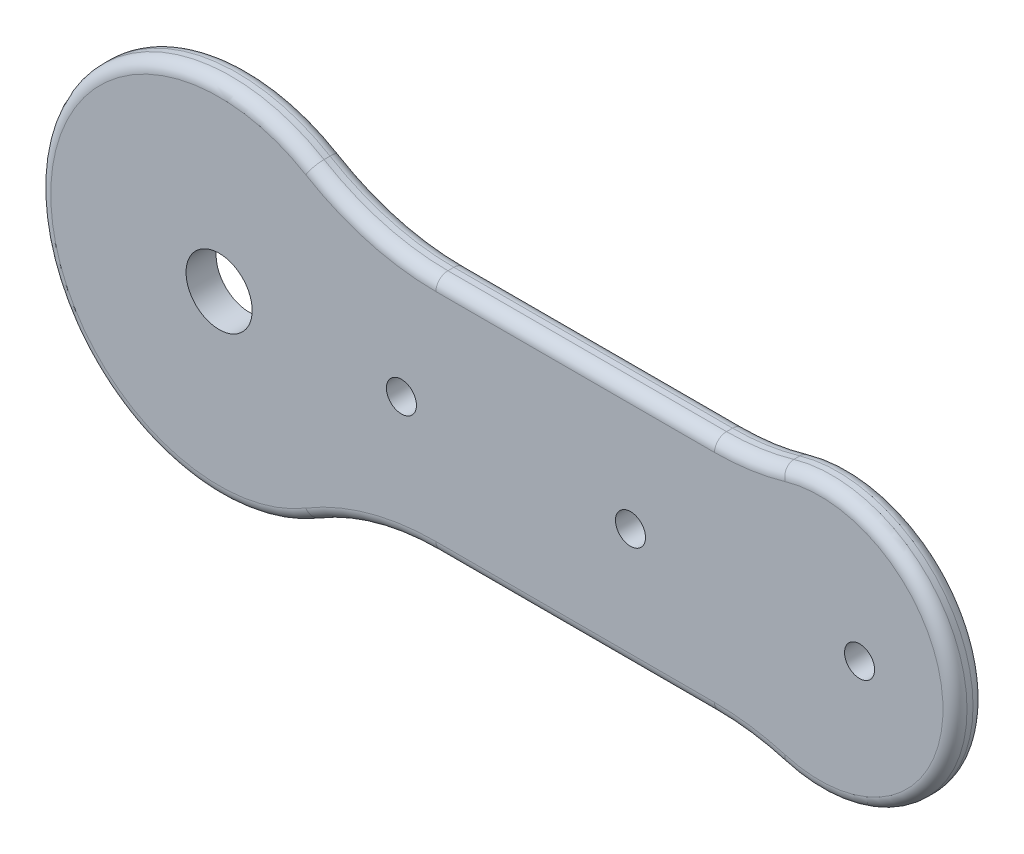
ISO-10303-21;
HEADER;
FILE_DESCRIPTION(('STEP AP214'),'2;1');
FILE_NAME('part.step','',(''),(''),'','','');
FILE_SCHEMA(('AUTOMOTIVE_DESIGN { 1 0 10303 214 1 1 1 1 }'));
ENDSEC;
DATA;
#1=APPLICATION_CONTEXT('core data for automotive mechanical design processes');
#2=APPLICATION_PROTOCOL_DEFINITION('international standard','automotive_design',2000,#1);
#3=PRODUCT_CONTEXT('',#1,'mechanical');
#4=PRODUCT('Part','Part','',(#3));
#5=PRODUCT_RELATED_PRODUCT_CATEGORY('part','',(#4));
#6=PRODUCT_DEFINITION_FORMATION('','',#4);
#7=PRODUCT_DEFINITION_CONTEXT('part definition',#1,'design');
#8=PRODUCT_DEFINITION('design','',#6,#7);
#9=PRODUCT_DEFINITION_SHAPE('','',#8);
#10=(LENGTH_UNIT() NAMED_UNIT(*) SI_UNIT(.MILLI.,.METRE.));
#11=(NAMED_UNIT(*) PLANE_ANGLE_UNIT() SI_UNIT($,.RADIAN.));
#12=(NAMED_UNIT(*) SI_UNIT($,.STERADIAN.) SOLID_ANGLE_UNIT());
#13=UNCERTAINTY_MEASURE_WITH_UNIT(LENGTH_MEASURE(1.E-05),#10,'distance_accuracy_value','');
#14=(GEOMETRIC_REPRESENTATION_CONTEXT(3) GLOBAL_UNCERTAINTY_ASSIGNED_CONTEXT((#13)) GLOBAL_UNIT_ASSIGNED_CONTEXT((#10,
#11,#12)) REPRESENTATION_CONTEXT('',''));
#15=CARTESIAN_POINT('',(0.,0.,0.));
#16=DIRECTION('',(0.,0.,1.));
#17=DIRECTION('',(1.,0.,0.));
#18=AXIS2_PLACEMENT_3D('',#15,#16,#17);
#19=CARTESIAN_POINT('',(0.,40.,10.));
#20=DIRECTION('',(0.,1.,0.));
#21=DIRECTION('',(0.,0.,1.));
#22=AXIS2_PLACEMENT_3D('',#19,#20,#21);
#23=PLANE('',#22);
#24=DIRECTION('',(0.,0.,-1.));
#25=VECTOR('',#24,1.);
#26=CARTESIAN_POINT('',(64.9,40.,10.));
#27=LINE('',#26,#25);
#28=CARTESIAN_POINT('',(64.9,40.,6.));
#29=VERTEX_POINT('',#28);
#30=CARTESIAN_POINT('',(64.9,40.,4.));
#31=VERTEX_POINT('',#30);
#32=EDGE_CURVE('E300',#29,#31,#27,.T.);
#33=ORIENTED_EDGE('',*,*,#32,.T.);
#34=DIRECTION('',(1.,0.,0.));
#35=VECTOR('',#34,1.);
#36=CARTESIAN_POINT('',(-27.7889744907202,40.,4.));
#37=LINE('',#36,#35);
#38=CARTESIAN_POINT('',(-27.7889744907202,40.,4.));
#39=VERTEX_POINT('',#38);
#40=EDGE_CURVE('E163',#31,#39,#37,.F.);
#41=ORIENTED_EDGE('',*,*,#40,.T.);
#42=DIRECTION('',(0.,0.,-1.));
#43=VECTOR('',#42,1.);
#44=CARTESIAN_POINT('',(-27.7889744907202,40.,10.));
#45=LINE('',#44,#43);
#46=CARTESIAN_POINT('',(-27.7889744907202,40.,6.));
#47=VERTEX_POINT('',#46);
#48=EDGE_CURVE('E309',#39,#47,#45,.F.);
#49=ORIENTED_EDGE('',*,*,#48,.T.);
#50=DIRECTION('',(1.,0.,0.));
#51=VECTOR('',#50,1.);
#52=CARTESIAN_POINT('',(0.,40.,6.));
#53=LINE('',#52,#51);
#54=EDGE_CURVE('E195',#47,#29,#53,.T.);
#55=ORIENTED_EDGE('',*,*,#54,.T.);
#56=EDGE_LOOP('',(#33,#41,#49,#55));
#57=FACE_BOUND('',#56,.T.);
#58=ADVANCED_FACE('F43',(#57),#23,.T.);
#59=CARTESIAN_POINT('',(-99.9,0.,10.));
#60=DIRECTION('',(0.,0.,-1.));
#61=DIRECTION('',(-1.,0.,0.));
#62=AXIS2_PLACEMENT_3D('',#59,#60,#61);
#63=CYLINDRICAL_SURFACE('',#62,60.);
#64=DIRECTION('',(0.,0.,-1.));
#65=VECTOR('',#64,1.);
#66=CARTESIAN_POINT('',(-68.9952747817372,51.4285714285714,10.));
#67=LINE('',#66,#65);
#68=CARTESIAN_POINT('',(-68.9952747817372,51.4285714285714,6.));
#69=VERTEX_POINT('',#68);
#70=CARTESIAN_POINT('',(-68.9952747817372,51.4285714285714,4.));
#71=VERTEX_POINT('',#70);
#72=EDGE_CURVE('E289',#69,#71,#67,.T.);
#73=ORIENTED_EDGE('',*,*,#72,.T.);
#74=CARTESIAN_POINT('',(-99.9,0.,4.));
#75=DIRECTION('',(0.,0.,1.));
#76=DIRECTION('',(1.,0.,0.));
#77=AXIS2_PLACEMENT_3D('',#74,#75,#76);
#78=CIRCLE('',#77,60.);
#79=CARTESIAN_POINT('',(-68.9952747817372,-51.4285714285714,4.));
#80=VERTEX_POINT('',#79);
#81=EDGE_CURVE('E200',#71,#80,#78,.T.);
#82=ORIENTED_EDGE('',*,*,#81,.T.);
#83=DIRECTION('',(0.,0.,-1.));
#84=VECTOR('',#83,1.);
#85=CARTESIAN_POINT('',(-68.9952747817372,-51.4285714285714,10.));
#86=LINE('',#85,#84);
#87=CARTESIAN_POINT('',(-68.9952747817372,-51.4285714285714,6.));
#88=VERTEX_POINT('',#87);
#89=EDGE_CURVE('E292',#80,#88,#86,.F.);
#90=ORIENTED_EDGE('',*,*,#89,.T.);
#91=CARTESIAN_POINT('',(-99.9,0.,6.));
#92=DIRECTION('',(0.,0.,1.));
#93=DIRECTION('',(1.,0.,0.));
#94=AXIS2_PLACEMENT_3D('',#91,#92,#93);
#95=CIRCLE('',#94,60.);
#96=EDGE_CURVE('E198',#88,#69,#95,.F.);
#97=ORIENTED_EDGE('',*,*,#96,.T.);
#98=EDGE_LOOP('',(#73,#82,#90,#97));
#99=FACE_BOUND('',#98,.T.);
#100=ADVANCED_FACE('F288',(#99),#63,.T.);
#101=CARTESIAN_POINT('',(0.,-40.,10.));
#102=DIRECTION('',(0.,1.,0.));
#103=DIRECTION('',(0.,0.,1.));
#104=AXIS2_PLACEMENT_3D('',#101,#102,#103);
#105=PLANE('',#104);
#106=DIRECTION('',(0.,0.,1.));
#107=VECTOR('',#106,1.);
#108=CARTESIAN_POINT('',(-27.7889744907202,-40.,0.));
#109=LINE('',#108,#107);
#110=CARTESIAN_POINT('',(-27.7889744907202,-40.,6.));
#111=VERTEX_POINT('',#110);
#112=CARTESIAN_POINT('',(-27.7889744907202,-40.,4.));
#113=VERTEX_POINT('',#112);
#114=EDGE_CURVE('E298',#111,#113,#109,.F.);
#115=ORIENTED_EDGE('',*,*,#114,.T.);
#116=DIRECTION('',(1.,0.,0.));
#117=VECTOR('',#116,1.);
#118=CARTESIAN_POINT('',(0.,-40.,4.));
#119=LINE('',#118,#117);
#120=CARTESIAN_POINT('',(64.9,-40.,4.));
#121=VERTEX_POINT('',#120);
#122=EDGE_CURVE('E204',#113,#121,#119,.T.);
#123=ORIENTED_EDGE('',*,*,#122,.T.);
#124=DIRECTION('',(0.,0.,1.));
#125=VECTOR('',#124,1.);
#126=CARTESIAN_POINT('',(64.9,-40.,10.));
#127=LINE('',#126,#125);
#128=CARTESIAN_POINT('',(64.9,-40.,6.));
#129=VERTEX_POINT('',#128);
#130=EDGE_CURVE('E303',#121,#129,#127,.T.);
#131=ORIENTED_EDGE('',*,*,#130,.T.);
#132=DIRECTION('',(1.,0.,0.));
#133=VECTOR('',#132,1.);
#134=CARTESIAN_POINT('',(-27.7889744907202,-40.,6.));
#135=LINE('',#134,#133);
#136=EDGE_CURVE('E202',#129,#111,#135,.F.);
#137=ORIENTED_EDGE('',*,*,#136,.T.);
#138=EDGE_LOOP('',(#115,#123,#131,#137));
#139=FACE_BOUND('',#138,.T.);
#140=ADVANCED_FACE('F359',(#139),#105,.F.);
#141=CARTESIAN_POINT('',(36.95,0.,10.));
#142=DIRECTION('',(0.,0.,-1.));
#143=DIRECTION('',(-1.,0.,0.));
#144=AXIS2_PLACEMENT_3D('',#141,#142,#143);
#145=CYLINDRICAL_SURFACE('',#144,5.);
#146=CARTESIAN_POINT('',(36.95,0.,10.));
#147=DIRECTION('',(0.,0.,1.));
#148=DIRECTION('',(1.,0.,0.));
#149=AXIS2_PLACEMENT_3D('',#146,#147,#148);
#150=CIRCLE('',#149,5.);
#151=CARTESIAN_POINT('',(41.95,0.,10.));
#152=VERTEX_POINT('',#151);
#153=EDGE_CURVE('E654',#152,#152,#150,.T.);
#154=ORIENTED_EDGE('',*,*,#153,.T.);
#155=EDGE_LOOP('',(#154));
#156=FACE_BOUND('',#155,.T.);
#157=CARTESIAN_POINT('',(36.95,0.,0.));
#158=DIRECTION('',(0.,0.,1.));
#159=DIRECTION('',(1.,0.,0.));
#160=AXIS2_PLACEMENT_3D('',#157,#158,#159);
#161=CIRCLE('',#160,5.);
#162=CARTESIAN_POINT('',(41.95,0.,0.));
#163=VERTEX_POINT('',#162);
#164=EDGE_CURVE('E657',#163,#163,#161,.T.);
#165=ORIENTED_EDGE('',*,*,#164,.F.);
#166=EDGE_LOOP('',(#165));
#167=FACE_BOUND('',#166,.T.);
#168=ADVANCED_FACE('F587',(#156,#167),#145,.F.);
#169=CARTESIAN_POINT('',(-39.25,-1.83164518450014E-13,10.));
#170=DIRECTION('',(0.,0.,-1.));
#171=DIRECTION('',(-1.,0.,0.));
#172=AXIS2_PLACEMENT_3D('',#169,#170,#171);
#173=CYLINDRICAL_SURFACE('',#172,5.);
#174=CARTESIAN_POINT('',(-39.25,-1.83164518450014E-13,10.));
#175=DIRECTION('',(0.,0.,1.));
#176=DIRECTION('',(1.,0.,0.));
#177=AXIS2_PLACEMENT_3D('',#174,#175,#176);
#178=CIRCLE('',#177,5.);
#179=CARTESIAN_POINT('',(-34.25,-1.83164518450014E-13,10.));
#180=VERTEX_POINT('',#179);
#181=EDGE_CURVE('E673',#180,#180,#178,.T.);
#182=ORIENTED_EDGE('',*,*,#181,.T.);
#183=EDGE_LOOP('',(#182));
#184=FACE_BOUND('',#183,.T.);
#185=CARTESIAN_POINT('',(-39.25,-1.83164518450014E-13,0.));
#186=DIRECTION('',(0.,0.,1.));
#187=DIRECTION('',(1.,0.,0.));
#188=AXIS2_PLACEMENT_3D('',#185,#186,#187);
#189=CIRCLE('',#188,5.);
#190=CARTESIAN_POINT('',(-34.25,-1.83164518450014E-13,0.));
#191=VERTEX_POINT('',#190);
#192=EDGE_CURVE('E660',#191,#191,#189,.T.);
#193=ORIENTED_EDGE('',*,*,#192,.F.);
#194=EDGE_LOOP('',(#193));
#195=FACE_BOUND('',#194,.T.);
#196=ADVANCED_FACE('F578',(#184,#195),#173,.F.);
#197=CARTESIAN_POINT('',(-99.9,0.,10.));
#198=DIRECTION('',(0.,0.,-1.));
#199=DIRECTION('',(-1.,0.,0.));
#200=AXIS2_PLACEMENT_3D('',#197,#198,#199);
#201=CYLINDRICAL_SURFACE('',#200,11.);
#202=CARTESIAN_POINT('',(-99.9,0.,10.));
#203=DIRECTION('',(0.,0.,1.));
#204=DIRECTION('',(1.,0.,0.));
#205=AXIS2_PLACEMENT_3D('',#202,#203,#204);
#206=CIRCLE('',#205,11.);
#207=CARTESIAN_POINT('',(-88.9,0.,10.));
#208=VERTEX_POINT('',#207);
#209=EDGE_CURVE('E663',#208,#208,#206,.T.);
#210=ORIENTED_EDGE('',*,*,#209,.T.);
#211=EDGE_LOOP('',(#210));
#212=FACE_BOUND('',#211,.T.);
#213=CARTESIAN_POINT('',(-99.9,0.,0.));
#214=DIRECTION('',(0.,0.,1.));
#215=DIRECTION('',(1.,0.,0.));
#216=AXIS2_PLACEMENT_3D('',#213,#214,#215);
#217=CIRCLE('',#216,11.);
#218=CARTESIAN_POINT('',(-88.9,0.,0.));
#219=VERTEX_POINT('',#218);
#220=EDGE_CURVE('E256',#219,#219,#217,.T.);
#221=ORIENTED_EDGE('',*,*,#220,.F.);
#222=EDGE_LOOP('',(#221));
#223=FACE_BOUND('',#222,.T.);
#224=ADVANCED_FACE('F570',(#212,#223),#201,.F.);
#225=CARTESIAN_POINT('',(99.9,0.,10.));
#226=DIRECTION('',(0.,0.,-1.));
#227=DIRECTION('',(-1.,0.,0.));
#228=AXIS2_PLACEMENT_3D('',#225,#226,#227);
#229=CYLINDRICAL_SURFACE('',#228,45.);
#230=DIRECTION('',(0.,0.,-1.));
#231=VECTOR('',#230,1.);
#232=CARTESIAN_POINT('',(87.3,-43.2,10.));
#233=LINE('',#232,#231);
#234=CARTESIAN_POINT('',(87.3,-43.2,6.));
#235=VERTEX_POINT('',#234);
#236=CARTESIAN_POINT('',(87.3,-43.2,4.));
#237=VERTEX_POINT('',#236);
#238=EDGE_CURVE('E176',#235,#237,#233,.T.);
#239=ORIENTED_EDGE('',*,*,#238,.T.);
#240=CARTESIAN_POINT('',(99.9,0.,4.));
#241=DIRECTION('',(0.,0.,1.));
#242=DIRECTION('',(1.,0.,0.));
#243=AXIS2_PLACEMENT_3D('',#240,#241,#242);
#244=CIRCLE('',#243,45.);
#245=CARTESIAN_POINT('',(87.3,43.2,4.));
#246=VERTEX_POINT('',#245);
#247=EDGE_CURVE('E209',#237,#246,#244,.T.);
#248=ORIENTED_EDGE('',*,*,#247,.T.);
#249=DIRECTION('',(0.,0.,-1.));
#250=VECTOR('',#249,1.);
#251=CARTESIAN_POINT('',(87.3,43.2,10.));
#252=LINE('',#251,#250);
#253=CARTESIAN_POINT('',(87.3,43.2,6.));
#254=VERTEX_POINT('',#253);
#255=EDGE_CURVE('E311',#246,#254,#252,.F.);
#256=ORIENTED_EDGE('',*,*,#255,.T.);
#257=CARTESIAN_POINT('',(99.9,0.,6.));
#258=DIRECTION('',(0.,0.,1.));
#259=DIRECTION('',(1.,0.,0.));
#260=AXIS2_PLACEMENT_3D('',#257,#258,#259);
#261=CIRCLE('',#260,45.);
#262=EDGE_CURVE('E206',#254,#235,#261,.F.);
#263=ORIENTED_EDGE('',*,*,#262,.T.);
#264=EDGE_LOOP('',(#239,#248,#256,#263));
#265=FACE_BOUND('',#264,.T.);
#266=ADVANCED_FACE('F318',(#265),#229,.T.);
#267=CARTESIAN_POINT('',(113.15,0.,10.));
#268=DIRECTION('',(0.,0.,-1.));
#269=DIRECTION('',(-1.,0.,0.));
#270=AXIS2_PLACEMENT_3D('',#267,#268,#269);
#271=CYLINDRICAL_SURFACE('',#270,5.);
#272=CARTESIAN_POINT('',(113.15,0.,10.));
#273=DIRECTION('',(0.,0.,1.));
#274=DIRECTION('',(1.,0.,0.));
#275=AXIS2_PLACEMENT_3D('',#272,#273,#274);
#276=CIRCLE('',#275,5.);
#277=CARTESIAN_POINT('',(118.15,0.,10.));
#278=VERTEX_POINT('',#277);
#279=EDGE_CURVE('E362',#278,#278,#276,.T.);
#280=ORIENTED_EDGE('',*,*,#279,.T.);
#281=EDGE_LOOP('',(#280));
#282=FACE_BOUND('',#281,.T.);
#283=CARTESIAN_POINT('',(113.15,0.,0.));
#284=DIRECTION('',(0.,0.,1.));
#285=DIRECTION('',(1.,0.,0.));
#286=AXIS2_PLACEMENT_3D('',#283,#284,#285);
#287=CIRCLE('',#286,5.);
#288=CARTESIAN_POINT('',(118.15,0.,0.));
#289=VERTEX_POINT('',#288);
#290=EDGE_CURVE('E659',#289,#289,#287,.T.);
#291=ORIENTED_EDGE('',*,*,#290,.F.);
#292=EDGE_LOOP('',(#291));
#293=FACE_BOUND('',#292,.T.);
#294=ADVANCED_FACE('F554',(#282,#293),#271,.F.);
#295=CARTESIAN_POINT('',(0.,0.,10.));
#296=DIRECTION('',(0.,0.,1.));
#297=DIRECTION('',(1.,0.,0.));
#298=AXIS2_PLACEMENT_3D('',#295,#296,#297);
#299=PLANE('',#298);
#300=CARTESIAN_POINT('',(-99.9,0.,10.));
#301=DIRECTION('',(0.,0.,1.));
#302=DIRECTION('',(1.,0.,0.));
#303=AXIS2_PLACEMENT_3D('',#300,#301,#302);
#304=CIRCLE('',#303,56.);
#305=CARTESIAN_POINT('',(-71.0555897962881,48.,10.));
#306=VERTEX_POINT('',#305);
#307=CARTESIAN_POINT('',(-71.0555897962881,-48.,10.));
#308=VERTEX_POINT('',#307);
#309=EDGE_CURVE('E65',#306,#308,#304,.T.);
#310=ORIENTED_EDGE('',*,*,#309,.T.);
#311=CARTESIAN_POINT('',(-27.7889744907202,-120.,10.));
#312=DIRECTION('',(0.,0.,1.));
#313=DIRECTION('',(1.,0.,0.));
#314=AXIS2_PLACEMENT_3D('',#311,#312,#313);
#315=CIRCLE('',#314,84.);
#316=CARTESIAN_POINT('',(-27.7889744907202,-36.,10.));
#317=VERTEX_POINT('',#316);
#318=EDGE_CURVE('E60',#308,#317,#315,.F.);
#319=ORIENTED_EDGE('',*,*,#318,.T.);
#320=DIRECTION('',(1.,0.,0.));
#321=VECTOR('',#320,1.);
#322=CARTESIAN_POINT('',(64.9,-36.,10.));
#323=LINE('',#322,#321);
#324=CARTESIAN_POINT('',(64.9,-36.,10.));
#325=VERTEX_POINT('',#324);
#326=EDGE_CURVE('E223',#317,#325,#323,.T.);
#327=ORIENTED_EDGE('',*,*,#326,.T.);
#328=CARTESIAN_POINT('',(64.9,-120.,10.));
#329=DIRECTION('',(0.,0.,1.));
#330=DIRECTION('',(1.,0.,0.));
#331=AXIS2_PLACEMENT_3D('',#328,#329,#330);
#332=CIRCLE('',#331,84.);
#333=CARTESIAN_POINT('',(88.42,-39.36,10.));
#334=VERTEX_POINT('',#333);
#335=EDGE_CURVE('E218',#325,#334,#332,.F.);
#336=ORIENTED_EDGE('',*,*,#335,.T.);
#337=CARTESIAN_POINT('',(99.9,0.,10.));
#338=DIRECTION('',(0.,0.,1.));
#339=DIRECTION('',(1.,0.,0.));
#340=AXIS2_PLACEMENT_3D('',#337,#338,#339);
#341=CIRCLE('',#340,41.);
#342=CARTESIAN_POINT('',(88.42,39.36,10.));
#343=VERTEX_POINT('',#342);
#344=EDGE_CURVE('E215',#334,#343,#341,.T.);
#345=ORIENTED_EDGE('',*,*,#344,.T.);
#346=CARTESIAN_POINT('',(64.9,120.,10.));
#347=DIRECTION('',(0.,0.,1.));
#348=DIRECTION('',(1.,0.,0.));
#349=AXIS2_PLACEMENT_3D('',#346,#347,#348);
#350=CIRCLE('',#349,84.);
#351=CARTESIAN_POINT('',(64.9,36.,10.));
#352=VERTEX_POINT('',#351);
#353=EDGE_CURVE('E211',#343,#352,#350,.F.);
#354=ORIENTED_EDGE('',*,*,#353,.T.);
#355=DIRECTION('',(1.,0.,0.));
#356=VECTOR('',#355,1.);
#357=CARTESIAN_POINT('',(0.,36.,10.));
#358=LINE('',#357,#356);
#359=CARTESIAN_POINT('',(-27.7889744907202,36.,10.));
#360=VERTEX_POINT('',#359);
#361=EDGE_CURVE('E213',#352,#360,#358,.F.);
#362=ORIENTED_EDGE('',*,*,#361,.T.);
#363=CARTESIAN_POINT('',(-27.7889744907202,120.,10.));
#364=DIRECTION('',(0.,0.,1.));
#365=DIRECTION('',(1.,0.,0.));
#366=AXIS2_PLACEMENT_3D('',#363,#364,#365);
#367=CIRCLE('',#366,84.);
#368=EDGE_CURVE('E220',#360,#306,#367,.F.);
#369=ORIENTED_EDGE('',*,*,#368,.T.);
#370=EDGE_LOOP('',(#310,#319,#327,#336,#345,#354,#362,#369));
#371=FACE_BOUND('',#370,.T.);
#372=ORIENTED_EDGE('',*,*,#209,.F.);
#373=EDGE_LOOP('',(#372));
#374=FACE_BOUND('',#373,.T.);
#375=ORIENTED_EDGE('',*,*,#181,.F.);
#376=EDGE_LOOP('',(#375));
#377=FACE_BOUND('',#376,.T.);
#378=ORIENTED_EDGE('',*,*,#153,.F.);
#379=EDGE_LOOP('',(#378));
#380=FACE_BOUND('',#379,.T.);
#381=ORIENTED_EDGE('',*,*,#279,.F.);
#382=EDGE_LOOP('',(#381));
#383=FACE_BOUND('',#382,.T.);
#384=ADVANCED_FACE('F366',(#371,#374,#377,#380,#383),#299,.T.);
#385=CARTESIAN_POINT('',(0.,0.,0.));
#386=DIRECTION('',(0.,0.,1.));
#387=DIRECTION('',(1.,0.,0.));
#388=AXIS2_PLACEMENT_3D('',#385,#386,#387);
#389=PLANE('',#388);
#390=DIRECTION('',(1.,0.,0.));
#391=VECTOR('',#390,1.);
#392=CARTESIAN_POINT('',(0.,-36.,0.));
#393=LINE('',#392,#391);
#394=CARTESIAN_POINT('',(64.9,-36.,0.));
#395=VERTEX_POINT('',#394);
#396=CARTESIAN_POINT('',(-27.7889744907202,-36.,0.));
#397=VERTEX_POINT('',#396);
#398=EDGE_CURVE('E189',#395,#397,#393,.F.);
#399=ORIENTED_EDGE('',*,*,#398,.T.);
#400=CARTESIAN_POINT('',(-27.7889744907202,-120.,0.));
#401=DIRECTION('',(0.,0.,1.));
#402=DIRECTION('',(1.,0.,0.));
#403=AXIS2_PLACEMENT_3D('',#400,#401,#402);
#404=CIRCLE('',#403,84.);
#405=CARTESIAN_POINT('',(-71.0555897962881,-48.,0.));
#406=VERTEX_POINT('',#405);
#407=EDGE_CURVE('E193',#397,#406,#404,.T.);
#408=ORIENTED_EDGE('',*,*,#407,.T.);
#409=CARTESIAN_POINT('',(-99.9,0.,0.));
#410=DIRECTION('',(0.,0.,1.));
#411=DIRECTION('',(1.,0.,0.));
#412=AXIS2_PLACEMENT_3D('',#409,#410,#411);
#413=CIRCLE('',#412,56.);
#414=CARTESIAN_POINT('',(-71.0555897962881,48.,0.));
#415=VERTEX_POINT('',#414);
#416=EDGE_CURVE('E191',#406,#415,#413,.F.);
#417=ORIENTED_EDGE('',*,*,#416,.T.);
#418=CARTESIAN_POINT('',(-27.7889744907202,120.,0.));
#419=DIRECTION('',(0.,0.,1.));
#420=DIRECTION('',(1.,0.,0.));
#421=AXIS2_PLACEMENT_3D('',#418,#419,#420);
#422=CIRCLE('',#421,84.);
#423=CARTESIAN_POINT('',(-27.7889744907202,36.,0.));
#424=VERTEX_POINT('',#423);
#425=EDGE_CURVE('E181',#415,#424,#422,.T.);
#426=ORIENTED_EDGE('',*,*,#425,.T.);
#427=DIRECTION('',(1.,0.,0.));
#428=VECTOR('',#427,1.);
#429=CARTESIAN_POINT('',(64.9,36.,0.));
#430=LINE('',#429,#428);
#431=CARTESIAN_POINT('',(64.9,36.,0.));
#432=VERTEX_POINT('',#431);
#433=EDGE_CURVE('E161',#424,#432,#430,.T.);
#434=ORIENTED_EDGE('',*,*,#433,.T.);
#435=CARTESIAN_POINT('',(64.9,120.,0.));
#436=DIRECTION('',(0.,0.,1.));
#437=DIRECTION('',(1.,0.,0.));
#438=AXIS2_PLACEMENT_3D('',#435,#436,#437);
#439=CIRCLE('',#438,84.);
#440=CARTESIAN_POINT('',(88.42,39.36,0.));
#441=VERTEX_POINT('',#440);
#442=EDGE_CURVE('E169',#432,#441,#439,.T.);
#443=ORIENTED_EDGE('',*,*,#442,.T.);
#444=CARTESIAN_POINT('',(99.9,0.,0.));
#445=DIRECTION('',(0.,0.,1.));
#446=DIRECTION('',(1.,0.,0.));
#447=AXIS2_PLACEMENT_3D('',#444,#445,#446);
#448=CIRCLE('',#447,41.);
#449=CARTESIAN_POINT('',(88.42,-39.36,0.));
#450=VERTEX_POINT('',#449);
#451=EDGE_CURVE('E175',#441,#450,#448,.F.);
#452=ORIENTED_EDGE('',*,*,#451,.T.);
#453=CARTESIAN_POINT('',(64.9,-120.,0.));
#454=DIRECTION('',(0.,0.,1.));
#455=DIRECTION('',(1.,0.,0.));
#456=AXIS2_PLACEMENT_3D('',#453,#454,#455);
#457=CIRCLE('',#456,84.);
#458=EDGE_CURVE('E183',#450,#395,#457,.T.);
#459=ORIENTED_EDGE('',*,*,#458,.T.);
#460=EDGE_LOOP('',(#399,#408,#417,#426,#434,#443,#452,#459));
#461=FACE_BOUND('',#460,.T.);
#462=ORIENTED_EDGE('',*,*,#220,.T.);
#463=EDGE_LOOP('',(#462));
#464=FACE_BOUND('',#463,.T.);
#465=ORIENTED_EDGE('',*,*,#192,.T.);
#466=EDGE_LOOP('',(#465));
#467=FACE_BOUND('',#466,.T.);
#468=ORIENTED_EDGE('',*,*,#164,.T.);
#469=EDGE_LOOP('',(#468));
#470=FACE_BOUND('',#469,.T.);
#471=ORIENTED_EDGE('',*,*,#290,.T.);
#472=EDGE_LOOP('',(#471));
#473=FACE_BOUND('',#472,.T.);
#474=ADVANCED_FACE('F178',(#461,#464,#467,#470,#473),#389,.F.);
#475=CARTESIAN_POINT('',(-27.7889744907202,-120.,10.));
#476=DIRECTION('',(0.,0.,-1.));
#477=DIRECTION('',(-1.,0.,0.));
#478=AXIS2_PLACEMENT_3D('',#475,#476,#477);
#479=CYLINDRICAL_SURFACE('',#478,80.);
#480=ORIENTED_EDGE('',*,*,#89,.F.);
#481=CARTESIAN_POINT('',(-27.7889744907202,-120.,4.));
#482=DIRECTION('',(0.,0.,1.));
#483=DIRECTION('',(1.,0.,0.));
#484=AXIS2_PLACEMENT_3D('',#481,#482,#483);
#485=CIRCLE('',#484,80.);
#486=EDGE_CURVE('E228',#80,#113,#485,.F.);
#487=ORIENTED_EDGE('',*,*,#486,.T.);
#488=ORIENTED_EDGE('',*,*,#114,.F.);
#489=CARTESIAN_POINT('',(-27.7889744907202,-120.,6.));
#490=DIRECTION('',(0.,0.,1.));
#491=DIRECTION('',(1.,0.,0.));
#492=AXIS2_PLACEMENT_3D('',#489,#490,#491);
#493=CIRCLE('',#492,80.);
#494=EDGE_CURVE('E226',#111,#88,#493,.T.);
#495=ORIENTED_EDGE('',*,*,#494,.T.);
#496=EDGE_LOOP('',(#480,#487,#488,#495));
#497=FACE_BOUND('',#496,.T.);
#498=ADVANCED_FACE('F385',(#497),#479,.F.);
#499=CARTESIAN_POINT('',(-27.7889744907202,120.,10.));
#500=DIRECTION('',(0.,0.,-1.));
#501=DIRECTION('',(-1.,0.,0.));
#502=AXIS2_PLACEMENT_3D('',#499,#500,#501);
#503=CYLINDRICAL_SURFACE('',#502,80.);
#504=ORIENTED_EDGE('',*,*,#48,.F.);
#505=CARTESIAN_POINT('',(-27.7889744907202,120.,4.));
#506=DIRECTION('',(0.,0.,1.));
#507=DIRECTION('',(1.,0.,0.));
#508=AXIS2_PLACEMENT_3D('',#505,#506,#507);
#509=CIRCLE('',#508,80.);
#510=EDGE_CURVE('E232',#39,#71,#509,.F.);
#511=ORIENTED_EDGE('',*,*,#510,.T.);
#512=ORIENTED_EDGE('',*,*,#72,.F.);
#513=CARTESIAN_POINT('',(-27.7889744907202,120.,6.));
#514=DIRECTION('',(0.,0.,1.));
#515=DIRECTION('',(1.,0.,0.));
#516=AXIS2_PLACEMENT_3D('',#513,#514,#515);
#517=CIRCLE('',#516,80.);
#518=EDGE_CURVE('E230',#69,#47,#517,.T.);
#519=ORIENTED_EDGE('',*,*,#518,.T.);
#520=EDGE_LOOP('',(#504,#511,#512,#519));
#521=FACE_BOUND('',#520,.T.);
#522=ADVANCED_FACE('F295',(#521),#503,.F.);
#523=CARTESIAN_POINT('',(64.9,-120.,10.));
#524=DIRECTION('',(0.,0.,-1.));
#525=DIRECTION('',(-1.,0.,0.));
#526=AXIS2_PLACEMENT_3D('',#523,#524,#525);
#527=CYLINDRICAL_SURFACE('',#526,80.);
#528=ORIENTED_EDGE('',*,*,#130,.F.);
#529=CARTESIAN_POINT('',(64.9,-120.,4.));
#530=DIRECTION('',(0.,0.,1.));
#531=DIRECTION('',(1.,0.,0.));
#532=AXIS2_PLACEMENT_3D('',#529,#530,#531);
#533=CIRCLE('',#532,80.);
#534=EDGE_CURVE('E236',#121,#237,#533,.F.);
#535=ORIENTED_EDGE('',*,*,#534,.T.);
#536=ORIENTED_EDGE('',*,*,#238,.F.);
#537=CARTESIAN_POINT('',(64.9,-120.,6.));
#538=DIRECTION('',(0.,0.,1.));
#539=DIRECTION('',(1.,0.,0.));
#540=AXIS2_PLACEMENT_3D('',#537,#538,#539);
#541=CIRCLE('',#540,80.);
#542=EDGE_CURVE('E234',#235,#129,#541,.T.);
#543=ORIENTED_EDGE('',*,*,#542,.T.);
#544=EDGE_LOOP('',(#528,#535,#536,#543));
#545=FACE_BOUND('',#544,.T.);
#546=ADVANCED_FACE('F355',(#545),#527,.F.);
#547=CARTESIAN_POINT('',(64.9,120.,10.));
#548=DIRECTION('',(0.,0.,-1.));
#549=DIRECTION('',(-1.,0.,0.));
#550=AXIS2_PLACEMENT_3D('',#547,#548,#549);
#551=CYLINDRICAL_SURFACE('',#550,80.);
#552=ORIENTED_EDGE('',*,*,#255,.F.);
#553=CARTESIAN_POINT('',(64.9,120.,4.));
#554=DIRECTION('',(0.,0.,1.));
#555=DIRECTION('',(1.,0.,0.));
#556=AXIS2_PLACEMENT_3D('',#553,#554,#555);
#557=CIRCLE('',#556,80.);
#558=EDGE_CURVE('E11',#246,#31,#557,.F.);
#559=ORIENTED_EDGE('',*,*,#558,.T.);
#560=ORIENTED_EDGE('',*,*,#32,.F.);
#561=CARTESIAN_POINT('',(64.9,120.,6.));
#562=DIRECTION('',(0.,0.,1.));
#563=DIRECTION('',(1.,0.,0.));
#564=AXIS2_PLACEMENT_3D('',#561,#562,#563);
#565=CIRCLE('',#564,80.);
#566=EDGE_CURVE('E52',#29,#254,#565,.T.);
#567=ORIENTED_EDGE('',*,*,#566,.T.);
#568=EDGE_LOOP('',(#552,#559,#560,#567));
#569=FACE_BOUND('',#568,.T.);
#570=ADVANCED_FACE('F331',(#569),#551,.F.);
#571=CARTESIAN_POINT('',(0.,-36.,4.));
#572=DIRECTION('',(1.,0.,0.));
#573=DIRECTION('',(0.,0.,-1.));
#574=AXIS2_PLACEMENT_3D('',#571,#572,#573);
#575=CYLINDRICAL_SURFACE('',#574,4.);
#576=CARTESIAN_POINT('',(64.9,-36.,4.));
#577=DIRECTION('',(1.,0.,0.));
#578=DIRECTION('',(0.,0.,-1.));
#579=AXIS2_PLACEMENT_3D('',#576,#577,#578);
#580=CIRCLE('',#579,4.);
#581=EDGE_CURVE('E250',#121,#395,#580,.T.);
#582=ORIENTED_EDGE('',*,*,#581,.F.);
#583=ORIENTED_EDGE('',*,*,#122,.F.);
#584=CARTESIAN_POINT('',(-27.7889744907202,-36.,4.));
#585=DIRECTION('',(-1.,0.,0.));
#586=DIRECTION('',(0.,0.,1.));
#587=AXIS2_PLACEMENT_3D('',#584,#585,#586);
#588=CIRCLE('',#587,4.);
#589=EDGE_CURVE('E253',#397,#113,#588,.T.);
#590=ORIENTED_EDGE('',*,*,#589,.F.);
#591=ORIENTED_EDGE('',*,*,#398,.F.);
#592=EDGE_LOOP('',(#582,#583,#590,#591));
#593=FACE_BOUND('',#592,.T.);
#594=ADVANCED_FACE('F395',(#593),#575,.T.);
#595=CARTESIAN_POINT('',(-27.7889744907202,-120.,4.));
#596=DIRECTION('',(0.,0.,1.));
#597=DIRECTION('',(1.,0.,0.));
#598=AXIS2_PLACEMENT_3D('',#595,#596,#597);
#599=TOROIDAL_SURFACE('',#598,84.,4.);
#600=ORIENTED_EDGE('',*,*,#589,.T.);
#601=ORIENTED_EDGE('',*,*,#486,.F.);
#602=CARTESIAN_POINT('',(-71.0555897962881,-48.,4.));
#603=DIRECTION('',(-0.857142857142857,-0.515078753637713,0.));
#604=DIRECTION('',(0.515078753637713,-0.857142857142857,0.));
#605=AXIS2_PLACEMENT_3D('',#602,#603,#604);
#606=CIRCLE('',#605,4.);
#607=EDGE_CURVE('E247',#406,#80,#606,.T.);
#608=ORIENTED_EDGE('',*,*,#607,.F.);
#609=ORIENTED_EDGE('',*,*,#407,.F.);
#610=EDGE_LOOP('',(#600,#601,#608,#609));
#611=FACE_BOUND('',#610,.T.);
#612=ADVANCED_FACE('F412',(#611),#599,.T.);
#613=CARTESIAN_POINT('',(64.9,-120.,4.));
#614=DIRECTION('',(0.,0.,1.));
#615=DIRECTION('',(1.,0.,0.));
#616=AXIS2_PLACEMENT_3D('',#613,#614,#615);
#617=TOROIDAL_SURFACE('',#616,84.,4.);
#618=ORIENTED_EDGE('',*,*,#581,.T.);
#619=ORIENTED_EDGE('',*,*,#458,.F.);
#620=CARTESIAN_POINT('',(88.42,-39.36,4.));
#621=DIRECTION('',(0.96,-0.279999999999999,0.));
#622=DIRECTION('',(0.279999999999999,0.96,0.));
#623=AXIS2_PLACEMENT_3D('',#620,#621,#622);
#624=CIRCLE('',#623,4.);
#625=EDGE_CURVE('E244',#237,#450,#624,.T.);
#626=ORIENTED_EDGE('',*,*,#625,.F.);
#627=ORIENTED_EDGE('',*,*,#534,.F.);
#628=EDGE_LOOP('',(#618,#619,#626,#627));
#629=FACE_BOUND('',#628,.T.);
#630=ADVANCED_FACE('F326',(#629),#617,.T.);
#631=CARTESIAN_POINT('',(-99.9,0.,4.));
#632=DIRECTION('',(0.,0.,1.));
#633=DIRECTION('',(1.,0.,0.));
#634=AXIS2_PLACEMENT_3D('',#631,#632,#633);
#635=TOROIDAL_SURFACE('',#634,56.,4.);
#636=ORIENTED_EDGE('',*,*,#607,.T.);
#637=ORIENTED_EDGE('',*,*,#81,.F.);
#638=CARTESIAN_POINT('',(-71.0555897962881,48.,4.));
#639=DIRECTION('',(0.857142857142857,-0.515078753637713,0.));
#640=DIRECTION('',(0.515078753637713,0.857142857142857,0.));
#641=AXIS2_PLACEMENT_3D('',#638,#639,#640);
#642=CIRCLE('',#641,4.);
#643=EDGE_CURVE('E241',#415,#71,#642,.T.);
#644=ORIENTED_EDGE('',*,*,#643,.F.);
#645=ORIENTED_EDGE('',*,*,#416,.F.);
#646=EDGE_LOOP('',(#636,#637,#644,#645));
#647=FACE_BOUND('',#646,.T.);
#648=ADVANCED_FACE('F406',(#647),#635,.T.);
#649=CARTESIAN_POINT('',(99.9,0.,4.));
#650=DIRECTION('',(0.,0.,1.));
#651=DIRECTION('',(1.,0.,0.));
#652=AXIS2_PLACEMENT_3D('',#649,#650,#651);
#653=TOROIDAL_SURFACE('',#652,41.,4.);
#654=ORIENTED_EDGE('',*,*,#625,.T.);
#655=ORIENTED_EDGE('',*,*,#451,.F.);
#656=CARTESIAN_POINT('',(88.42,39.36,4.));
#657=DIRECTION('',(-0.96,-0.279999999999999,0.));
#658=DIRECTION('',(0.279999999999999,-0.96,0.));
#659=AXIS2_PLACEMENT_3D('',#656,#657,#658);
#660=CIRCLE('',#659,4.);
#661=EDGE_CURVE('E172',#246,#441,#660,.T.);
#662=ORIENTED_EDGE('',*,*,#661,.F.);
#663=ORIENTED_EDGE('',*,*,#247,.F.);
#664=EDGE_LOOP('',(#654,#655,#662,#663));
#665=FACE_BOUND('',#664,.T.);
#666=ADVANCED_FACE('F328',(#665),#653,.T.);
#667=CARTESIAN_POINT('',(-27.7889744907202,120.,4.));
#668=DIRECTION('',(0.,0.,1.));
#669=DIRECTION('',(1.,0.,0.));
#670=AXIS2_PLACEMENT_3D('',#667,#668,#669);
#671=TOROIDAL_SURFACE('',#670,84.,4.);
#672=ORIENTED_EDGE('',*,*,#643,.T.);
#673=ORIENTED_EDGE('',*,*,#510,.F.);
#674=CARTESIAN_POINT('',(-27.7889744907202,36.,4.));
#675=DIRECTION('',(1.,0.,0.));
#676=DIRECTION('',(0.,0.,-1.));
#677=AXIS2_PLACEMENT_3D('',#674,#675,#676);
#678=CIRCLE('',#677,4.);
#679=EDGE_CURVE('E166',#424,#39,#678,.T.);
#680=ORIENTED_EDGE('',*,*,#679,.F.);
#681=ORIENTED_EDGE('',*,*,#425,.F.);
#682=EDGE_LOOP('',(#672,#673,#680,#681));
#683=FACE_BOUND('',#682,.T.);
#684=ADVANCED_FACE('F400',(#683),#671,.T.);
#685=CARTESIAN_POINT('',(64.9,120.,4.));
#686=DIRECTION('',(0.,0.,1.));
#687=DIRECTION('',(1.,0.,0.));
#688=AXIS2_PLACEMENT_3D('',#685,#686,#687);
#689=TOROIDAL_SURFACE('',#688,84.,4.);
#690=ORIENTED_EDGE('',*,*,#661,.T.);
#691=ORIENTED_EDGE('',*,*,#442,.F.);
#692=CARTESIAN_POINT('',(64.9,36.,4.));
#693=DIRECTION('',(-1.,0.,0.));
#694=DIRECTION('',(0.,0.,1.));
#695=AXIS2_PLACEMENT_3D('',#692,#693,#694);
#696=CIRCLE('',#695,4.);
#697=EDGE_CURVE('E157',#31,#432,#696,.T.);
#698=ORIENTED_EDGE('',*,*,#697,.F.);
#699=ORIENTED_EDGE('',*,*,#558,.F.);
#700=EDGE_LOOP('',(#690,#691,#698,#699));
#701=FACE_BOUND('',#700,.T.);
#702=ADVANCED_FACE('F170',(#701),#689,.T.);
#703=CARTESIAN_POINT('',(0.,36.,4.));
#704=DIRECTION('',(-1.,0.,0.));
#705=DIRECTION('',(0.,0.,1.));
#706=AXIS2_PLACEMENT_3D('',#703,#704,#705);
#707=CYLINDRICAL_SURFACE('',#706,4.);
#708=ORIENTED_EDGE('',*,*,#679,.T.);
#709=ORIENTED_EDGE('',*,*,#40,.F.);
#710=ORIENTED_EDGE('',*,*,#697,.T.);
#711=ORIENTED_EDGE('',*,*,#433,.F.);
#712=EDGE_LOOP('',(#708,#709,#710,#711));
#713=FACE_BOUND('',#712,.T.);
#714=ADVANCED_FACE('F159',(#713),#707,.T.);
#715=CARTESIAN_POINT('',(-99.9,0.,6.));
#716=DIRECTION('',(0.,0.,1.));
#717=DIRECTION('',(1.,0.,0.));
#718=AXIS2_PLACEMENT_3D('',#715,#716,#717);
#719=TOROIDAL_SURFACE('',#718,56.,4.);
#720=CARTESIAN_POINT('',(-71.0555897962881,48.,6.));
#721=DIRECTION('',(0.857142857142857,-0.515078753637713,0.));
#722=DIRECTION('',(0.515078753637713,0.857142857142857,0.));
#723=AXIS2_PLACEMENT_3D('',#720,#721,#722);
#724=CIRCLE('',#723,4.);
#725=EDGE_CURVE('E272',#69,#306,#724,.T.);
#726=ORIENTED_EDGE('',*,*,#725,.F.);
#727=ORIENTED_EDGE('',*,*,#96,.F.);
#728=CARTESIAN_POINT('',(-71.0555897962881,-48.,6.));
#729=DIRECTION('',(0.857142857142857,0.515078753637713,0.));
#730=DIRECTION('',(-0.515078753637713,0.857142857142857,0.));
#731=AXIS2_PLACEMENT_3D('',#728,#729,#730);
#732=CIRCLE('',#731,4.);
#733=EDGE_CURVE('E47',#308,#88,#732,.T.);
#734=ORIENTED_EDGE('',*,*,#733,.F.);
#735=ORIENTED_EDGE('',*,*,#309,.F.);
#736=EDGE_LOOP('',(#726,#727,#734,#735));
#737=FACE_BOUND('',#736,.T.);
#738=ADVANCED_FACE('F45',(#737),#719,.T.);
#739=CARTESIAN_POINT('',(-27.7889744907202,-120.,6.));
#740=DIRECTION('',(0.,0.,1.));
#741=DIRECTION('',(1.,0.,0.));
#742=AXIS2_PLACEMENT_3D('',#739,#740,#741);
#743=TOROIDAL_SURFACE('',#742,84.,4.);
#744=ORIENTED_EDGE('',*,*,#733,.T.);
#745=ORIENTED_EDGE('',*,*,#494,.F.);
#746=CARTESIAN_POINT('',(-27.7889744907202,-36.,6.));
#747=DIRECTION('',(1.,0.,0.));
#748=DIRECTION('',(0.,0.,-1.));
#749=AXIS2_PLACEMENT_3D('',#746,#747,#748);
#750=CIRCLE('',#749,4.);
#751=EDGE_CURVE('E270',#317,#111,#750,.T.);
#752=ORIENTED_EDGE('',*,*,#751,.F.);
#753=ORIENTED_EDGE('',*,*,#318,.F.);
#754=EDGE_LOOP('',(#744,#745,#752,#753));
#755=FACE_BOUND('',#754,.T.);
#756=ADVANCED_FACE('F281',(#755),#743,.T.);
#757=CARTESIAN_POINT('',(-27.7889744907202,120.,6.));
#758=DIRECTION('',(0.,0.,1.));
#759=DIRECTION('',(1.,0.,0.));
#760=AXIS2_PLACEMENT_3D('',#757,#758,#759);
#761=TOROIDAL_SURFACE('',#760,84.,4.);
#762=ORIENTED_EDGE('',*,*,#725,.T.);
#763=ORIENTED_EDGE('',*,*,#368,.F.);
#764=CARTESIAN_POINT('',(-27.7889744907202,36.,6.));
#765=DIRECTION('',(1.,0.,0.));
#766=DIRECTION('',(0.,0.,-1.));
#767=AXIS2_PLACEMENT_3D('',#764,#765,#766);
#768=CIRCLE('',#767,4.);
#769=EDGE_CURVE('E267',#47,#360,#768,.T.);
#770=ORIENTED_EDGE('',*,*,#769,.F.);
#771=ORIENTED_EDGE('',*,*,#518,.F.);
#772=EDGE_LOOP('',(#762,#763,#770,#771));
#773=FACE_BOUND('',#772,.T.);
#774=ADVANCED_FACE('F368',(#773),#761,.T.);
#775=CARTESIAN_POINT('',(0.,-36.,6.));
#776=DIRECTION('',(-1.,0.,0.));
#777=DIRECTION('',(0.,0.,1.));
#778=AXIS2_PLACEMENT_3D('',#775,#776,#777);
#779=CYLINDRICAL_SURFACE('',#778,4.);
#780=ORIENTED_EDGE('',*,*,#751,.T.);
#781=ORIENTED_EDGE('',*,*,#136,.F.);
#782=CARTESIAN_POINT('',(64.9,-36.,6.));
#783=DIRECTION('',(1.,0.,0.));
#784=DIRECTION('',(0.,0.,-1.));
#785=AXIS2_PLACEMENT_3D('',#782,#783,#784);
#786=CIRCLE('',#785,4.);
#787=EDGE_CURVE('E264',#325,#129,#786,.T.);
#788=ORIENTED_EDGE('',*,*,#787,.F.);
#789=ORIENTED_EDGE('',*,*,#326,.F.);
#790=EDGE_LOOP('',(#780,#781,#788,#789));
#791=FACE_BOUND('',#790,.T.);
#792=ADVANCED_FACE('F364',(#791),#779,.T.);
#793=CARTESIAN_POINT('',(0.,36.,6.));
#794=DIRECTION('',(1.,0.,0.));
#795=DIRECTION('',(0.,0.,-1.));
#796=AXIS2_PLACEMENT_3D('',#793,#794,#795);
#797=CYLINDRICAL_SURFACE('',#796,4.);
#798=ORIENTED_EDGE('',*,*,#769,.T.);
#799=ORIENTED_EDGE('',*,*,#361,.F.);
#800=CARTESIAN_POINT('',(64.9,36.,6.));
#801=DIRECTION('',(1.,0.,0.));
#802=DIRECTION('',(0.,0.,-1.));
#803=AXIS2_PLACEMENT_3D('',#800,#801,#802);
#804=CIRCLE('',#803,4.);
#805=EDGE_CURVE('E261',#29,#352,#804,.T.);
#806=ORIENTED_EDGE('',*,*,#805,.F.);
#807=ORIENTED_EDGE('',*,*,#54,.F.);
#808=EDGE_LOOP('',(#798,#799,#806,#807));
#809=FACE_BOUND('',#808,.T.);
#810=ADVANCED_FACE('F337',(#809),#797,.T.);
#811=CARTESIAN_POINT('',(64.9,-120.,6.));
#812=DIRECTION('',(0.,0.,1.));
#813=DIRECTION('',(1.,0.,0.));
#814=AXIS2_PLACEMENT_3D('',#811,#812,#813);
#815=TOROIDAL_SURFACE('',#814,84.,4.);
#816=ORIENTED_EDGE('',*,*,#787,.T.);
#817=ORIENTED_EDGE('',*,*,#542,.F.);
#818=CARTESIAN_POINT('',(88.42,-39.36,6.));
#819=DIRECTION('',(0.960000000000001,-0.279999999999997,0.));
#820=DIRECTION('',(0.279999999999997,0.960000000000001,0.));
#821=AXIS2_PLACEMENT_3D('',#818,#819,#820);
#822=CIRCLE('',#821,4.);
#823=EDGE_CURVE('E259',#334,#235,#822,.T.);
#824=ORIENTED_EDGE('',*,*,#823,.F.);
#825=ORIENTED_EDGE('',*,*,#335,.F.);
#826=EDGE_LOOP('',(#816,#817,#824,#825));
#827=FACE_BOUND('',#826,.T.);
#828=ADVANCED_FACE('F351',(#827),#815,.T.);
#829=CARTESIAN_POINT('',(64.9,120.,6.));
#830=DIRECTION('',(0.,0.,1.));
#831=DIRECTION('',(1.,0.,0.));
#832=AXIS2_PLACEMENT_3D('',#829,#830,#831);
#833=TOROIDAL_SURFACE('',#832,84.,4.);
#834=ORIENTED_EDGE('',*,*,#805,.T.);
#835=ORIENTED_EDGE('',*,*,#353,.F.);
#836=CARTESIAN_POINT('',(88.42,39.36,6.));
#837=DIRECTION('',(0.96,0.279999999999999,0.));
#838=DIRECTION('',(-0.279999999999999,0.96,0.));
#839=AXIS2_PLACEMENT_3D('',#836,#837,#838);
#840=CIRCLE('',#839,4.);
#841=EDGE_CURVE('E257',#254,#343,#840,.T.);
#842=ORIENTED_EDGE('',*,*,#841,.F.);
#843=ORIENTED_EDGE('',*,*,#566,.F.);
#844=EDGE_LOOP('',(#834,#835,#842,#843));
#845=FACE_BOUND('',#844,.T.);
#846=ADVANCED_FACE('F343',(#845),#833,.T.);
#847=CARTESIAN_POINT('',(99.9,0.,6.));
#848=DIRECTION('',(0.,0.,1.));
#849=DIRECTION('',(1.,0.,0.));
#850=AXIS2_PLACEMENT_3D('',#847,#848,#849);
#851=TOROIDAL_SURFACE('',#850,41.,4.);
#852=ORIENTED_EDGE('',*,*,#823,.T.);
#853=ORIENTED_EDGE('',*,*,#262,.F.);
#854=ORIENTED_EDGE('',*,*,#841,.T.);
#855=ORIENTED_EDGE('',*,*,#344,.F.);
#856=EDGE_LOOP('',(#852,#853,#854,#855));
#857=FACE_BOUND('',#856,.T.);
#858=ADVANCED_FACE('F345',(#857),#851,.T.);
#859=CLOSED_SHELL('',(#58,#100,#140,#168,#196,#224,#266,#294,#384,#474,#498,#522,#546,#570,#594,
#612,#630,#648,#666,#684,#702,#714,#738,#756,#774,#792,#810,#828,#846,#858));
#860=MANIFOLD_SOLID_BREP('B2',#859);
#861=ADVANCED_BREP_SHAPE_REPRESENTATION('',(#18,#860),#14);
#862=SHAPE_DEFINITION_REPRESENTATION(#9,#861);
ENDSEC;
END-ISO-10303-21;
